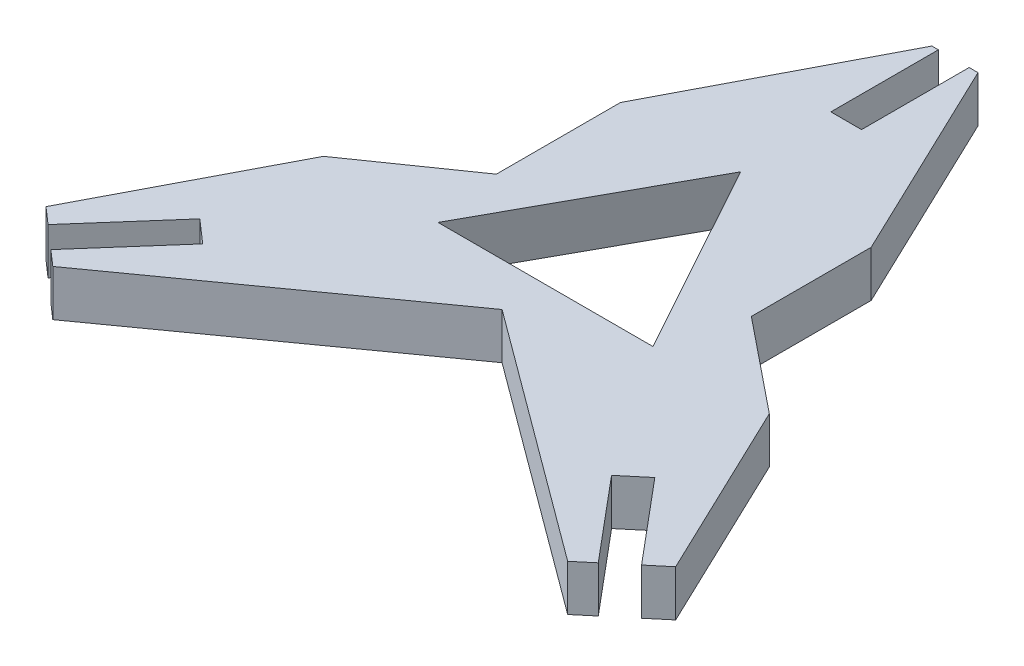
from build123d import *

# Parameters (mm, degrees)
BOSS_EXTRUDE7_DEPTH = 3
CUT_EXTRUDE3_DEPTH  = 3
CUT_EXTRUDE4_DEPTH  = 3
SKETCH4_W           = 2
SKETCH4_H           = 7
CUT_EXTRUDE5_DEPTH  = 3
CUT_EXTRUDE6_DEPTH  = 3
CUT_EXTRUDE8_DEPTH  = 4.25


with BuildPart() as part:
    # Sketch1 → Boss-Extrude7 (new body)
    with BuildSketch(Plane(origin=(0, 0, 0), x_dir=(1, 0, 0), z_dir=(0, 1, 0))):
        Polygon((33.722143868, -31.83471834), (18.655790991, -31.83471834), (25.401207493, -16.188084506), align=None)
        Polygon((26.104324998, 0), (9.483848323, -31.83471834), (18.655790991, -31.83471834), (25.401207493, -16.188084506), (33.722143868, -31.83471834), (41.318566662, -31.83471834), align=None)
        Polygon((9.483848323, -31.83471834), (0, -50), (25.401207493, -31.83471834), (18.655790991, -31.83471834), align=None)
        Polygon((33.722143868, -31.83471834), (25.401207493, -31.83471834), (50, -50), (41.318566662, -31.83471834), align=None)
    extrude(amount=BOSS_EXTRUDE7_DEPTH)

    # Sketch2 → Cut-Extrude3 (cut)
    with BuildSketch(Plane(origin=(0, 3, 0), x_dir=(1, 0, 0), z_dir=(0, 1, 0))):
        Polygon((18.407700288, -29.011283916), (32.394714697, -29.011283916), (25.401207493, -16.314698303), align=None)
    extrude(amount=-CUT_EXTRUDE3_DEPTH, mode=Mode.SUBTRACT)

    # Sketch3 → Cut-Extrude4 (cut)
    with BuildSketch(Plane(origin=(0, 3, 0), x_dir=(1, 0, 0), z_dir=(0, 1, 0))):
        Polygon((5.841858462, -41.82242764), (10.457433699, -36.559684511), (11.961074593, -37.878420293), (7.345499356, -43.141163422), align=None)
        Polygon((42.807323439, -42.98106818), (38.308760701, -37.617959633), (39.841077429, -36.332655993), (44.339640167, -41.695764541), align=None)
        Polygon((45.547211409, -40.682856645), (44.339640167, -41.695764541), (42.807323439, -42.98106818), (41.724806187, -43.889081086), (50, -50), align=None)
        Polygon((0, -50), (4.73121126, -40.93787857), (4.763269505, -40.876474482), (4.833283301, -40.93787857), (8.354074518, -44.025712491), align=None)
    extrude(amount=-CUT_EXTRUDE4_DEPTH, mode=Mode.SUBTRACT)

    # Sketch4 → Cut-Extrude5 (cut)
    with BuildSketch(Plane(origin=(0, 3, 0), x_dir=(1, 0, 0), z_dir=(0, 1, 0))):
        Polygon((26.104324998, 0), (24.960762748, -3), (26.960762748, -3), (27.538065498, -3), align=None)
        with Locations((25.960762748, -6.5)):
            Rectangle(SKETCH4_W, SKETCH4_H)
    extrude(amount=-CUT_EXTRUDE5_DEPTH, mode=Mode.SUBTRACT)

    # Sketch5 → Cut-Extrude6 (cut)
    with BuildSketch(Plane(origin=(0, 3, 0), x_dir=(1, 0, 0), z_dir=(0, 1, 0))):
        Polygon((10.957925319, -29.011283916), (17.586641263, -16.314698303), (17.586641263, -24.393372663), align=None)
        Polygon((33.901339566, -16.314698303), (39.969209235, -29.011283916), (33.901339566, -24.112949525), align=None)
    extrude(amount=-CUT_EXTRUDE6_DEPTH, mode=Mode.SUBTRACT)

    # Sketch6 → Cut-Extrude8 (cut)
    with BuildSketch(Plane(origin=(0, 3, 0), x_dir=(1, 0, 0), z_dir=(0, 1, 0))):
        Polygon((24.960762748, -3), (24.538065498, -3), (26.104324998, 0), align=None)
    extrude(amount=-CUT_EXTRUDE8_DEPTH, mode=Mode.SUBTRACT)


solid = part.part
